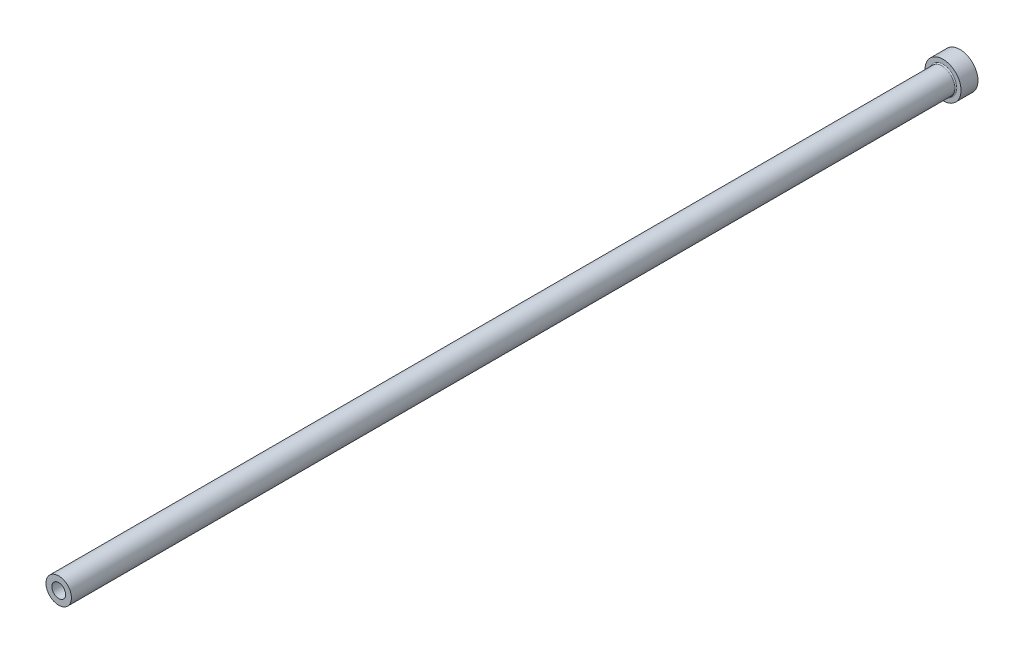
ISO-10303-21;
HEADER;
FILE_DESCRIPTION(('STEP AP214'),'2;1');
FILE_NAME('part.step','',(''),(''),'','','');
FILE_SCHEMA(('AUTOMOTIVE_DESIGN { 1 0 10303 214 1 1 1 1 }'));
ENDSEC;
DATA;
#1=APPLICATION_CONTEXT('core data for automotive mechanical design processes');
#2=APPLICATION_PROTOCOL_DEFINITION('international standard','automotive_design',2000,#1);
#3=PRODUCT_CONTEXT('',#1,'mechanical');
#4=PRODUCT('Part','Part','',(#3));
#5=PRODUCT_RELATED_PRODUCT_CATEGORY('part','',(#4));
#6=PRODUCT_DEFINITION_FORMATION('','',#4);
#7=PRODUCT_DEFINITION_CONTEXT('part definition',#1,'design');
#8=PRODUCT_DEFINITION('design','',#6,#7);
#9=PRODUCT_DEFINITION_SHAPE('','',#8);
#10=(LENGTH_UNIT() NAMED_UNIT(*) SI_UNIT(.MILLI.,.METRE.));
#11=(NAMED_UNIT(*) PLANE_ANGLE_UNIT() SI_UNIT($,.RADIAN.));
#12=(NAMED_UNIT(*) SI_UNIT($,.STERADIAN.) SOLID_ANGLE_UNIT());
#13=UNCERTAINTY_MEASURE_WITH_UNIT(LENGTH_MEASURE(1.E-05),#10,'distance_accuracy_value','');
#14=(GEOMETRIC_REPRESENTATION_CONTEXT(3) GLOBAL_UNCERTAINTY_ASSIGNED_CONTEXT((#13)) GLOBAL_UNIT_ASSIGNED_CONTEXT((#10,
#11,#12)) REPRESENTATION_CONTEXT('',''));
#15=CARTESIAN_POINT('',(0.,0.,0.));
#16=DIRECTION('',(0.,0.,1.));
#17=DIRECTION('',(1.,0.,0.));
#18=AXIS2_PLACEMENT_3D('',#15,#16,#17);
#19=CARTESIAN_POINT('',(0.,0.,425.));
#20=DIRECTION('',(0.,0.,-1.));
#21=DIRECTION('',(-1.,0.,0.));
#22=AXIS2_PLACEMENT_3D('',#19,#20,#21);
#23=PLANE('',#22);
#24=CARTESIAN_POINT('',(0.,0.,425.));
#25=DIRECTION('',(0.,0.,1.));
#26=DIRECTION('',(1.,0.,0.));
#27=AXIS2_PLACEMENT_3D('',#24,#25,#26);
#28=CIRCLE('',#27,3.24999999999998);
#29=CARTESIAN_POINT('',(3.24999999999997,0.,425.));
#30=VERTEX_POINT('',#29);
#31=EDGE_CURVE('E63',#30,#30,#28,.T.);
#32=ORIENTED_EDGE('',*,*,#31,.F.);
#33=EDGE_LOOP('',(#32));
#34=FACE_BOUND('',#33,.T.);
#35=CARTESIAN_POINT('',(0.,0.,425.));
#36=DIRECTION('',(0.,0.,1.));
#37=DIRECTION('',(1.,0.,0.));
#38=AXIS2_PLACEMENT_3D('',#35,#36,#37);
#39=CIRCLE('',#38,5.99999999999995);
#40=CARTESIAN_POINT('',(5.99999999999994,0.,425.));
#41=VERTEX_POINT('',#40);
#42=EDGE_CURVE('E54',#41,#41,#39,.T.);
#43=ORIENTED_EDGE('',*,*,#42,.T.);
#44=EDGE_LOOP('',(#43));
#45=FACE_BOUND('',#44,.T.);
#46=ADVANCED_FACE('F34',(#34,#45),#23,.F.);
#47=CARTESIAN_POINT('',(0.,0.,425.));
#48=DIRECTION('',(0.,0.,1.));
#49=DIRECTION('',(1.,0.,0.));
#50=AXIS2_PLACEMENT_3D('',#47,#48,#49);
#51=CYLINDRICAL_SURFACE('',#50,5.99999999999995);
#52=CARTESIAN_POINT('',(0.,0.,8.50000000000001));
#53=DIRECTION('',(0.,0.,1.));
#54=DIRECTION('',(1.,0.,0.));
#55=AXIS2_PLACEMENT_3D('',#52,#53,#54);
#56=CIRCLE('',#55,5.99999999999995);
#57=CARTESIAN_POINT('',(5.99999999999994,0.,8.50000000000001));
#58=VERTEX_POINT('',#57);
#59=EDGE_CURVE('E49',#58,#58,#56,.T.);
#60=ORIENTED_EDGE('',*,*,#59,.T.);
#61=EDGE_LOOP('',(#60));
#62=FACE_BOUND('',#61,.T.);
#63=ORIENTED_EDGE('',*,*,#42,.F.);
#64=EDGE_LOOP('',(#63));
#65=FACE_BOUND('',#64,.T.);
#66=ADVANCED_FACE('F92',(#62,#65),#51,.T.);
#67=CARTESIAN_POINT('',(0.,0.,8.));
#68=DIRECTION('',(0.,0.,1.));
#69=DIRECTION('',(1.,0.,0.));
#70=AXIS2_PLACEMENT_3D('',#67,#68,#69);
#71=PLANE('',#70);
#72=CARTESIAN_POINT('',(0.,0.,8.));
#73=DIRECTION('',(0.,0.,1.));
#74=DIRECTION('',(1.,0.,0.));
#75=AXIS2_PLACEMENT_3D('',#72,#73,#74);
#76=CIRCLE('',#75,6.49999999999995);
#77=CARTESIAN_POINT('',(6.49999999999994,0.,8.));
#78=VERTEX_POINT('',#77);
#79=EDGE_CURVE('E45',#78,#78,#76,.F.);
#80=ORIENTED_EDGE('',*,*,#79,.T.);
#81=EDGE_LOOP('',(#80));
#82=FACE_BOUND('',#81,.T.);
#83=CARTESIAN_POINT('',(0.,0.,8.00000000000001));
#84=DIRECTION('',(0.,0.,1.));
#85=DIRECTION('',(1.,0.,0.));
#86=AXIS2_PLACEMENT_3D('',#83,#84,#85);
#87=CIRCLE('',#86,8.49999999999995);
#88=CARTESIAN_POINT('',(8.49999999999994,0.,8.00000000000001));
#89=VERTEX_POINT('',#88);
#90=EDGE_CURVE('E57',#89,#89,#87,.T.);
#91=ORIENTED_EDGE('',*,*,#90,.T.);
#92=EDGE_LOOP('',(#91));
#93=FACE_BOUND('',#92,.T.);
#94=ADVANCED_FACE('F98',(#82,#93),#71,.T.);
#95=CARTESIAN_POINT('',(0.,0.,425.));
#96=DIRECTION('',(0.,0.,1.));
#97=DIRECTION('',(1.,0.,0.));
#98=AXIS2_PLACEMENT_3D('',#95,#96,#97);
#99=CYLINDRICAL_SURFACE('',#98,8.49999999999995);
#100=ORIENTED_EDGE('',*,*,#90,.F.);
#101=EDGE_LOOP('',(#100));
#102=FACE_BOUND('',#101,.T.);
#103=CARTESIAN_POINT('',(0.,0.,0.));
#104=DIRECTION('',(0.,0.,1.));
#105=DIRECTION('',(1.,0.,0.));
#106=AXIS2_PLACEMENT_3D('',#103,#104,#105);
#107=CIRCLE('',#106,8.49999999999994);
#108=CARTESIAN_POINT('',(8.49999999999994,0.,0.));
#109=VERTEX_POINT('',#108);
#110=EDGE_CURVE('E60',#109,#109,#107,.T.);
#111=ORIENTED_EDGE('',*,*,#110,.T.);
#112=EDGE_LOOP('',(#111));
#113=FACE_BOUND('',#112,.T.);
#114=ADVANCED_FACE('F89',(#102,#113),#99,.T.);
#115=CARTESIAN_POINT('',(0.,0.,0.));
#116=DIRECTION('',(0.,0.,1.));
#117=DIRECTION('',(1.,0.,0.));
#118=AXIS2_PLACEMENT_3D('',#115,#116,#117);
#119=PLANE('',#118);
#120=CARTESIAN_POINT('',(0.,0.,0.));
#121=DIRECTION('',(0.,0.,1.));
#122=DIRECTION('',(1.,0.,0.));
#123=AXIS2_PLACEMENT_3D('',#120,#121,#122);
#124=CIRCLE('',#123,3.99999999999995);
#125=CARTESIAN_POINT('',(3.99999999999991,0.,0.));
#126=VERTEX_POINT('',#125);
#127=EDGE_CURVE('E41',#126,#126,#124,.T.);
#128=ORIENTED_EDGE('',*,*,#127,.T.);
#129=EDGE_LOOP('',(#128));
#130=FACE_BOUND('',#129,.T.);
#131=ORIENTED_EDGE('',*,*,#110,.F.);
#132=EDGE_LOOP('',(#131));
#133=FACE_BOUND('',#132,.T.);
#134=ADVANCED_FACE('F83',(#130,#133),#119,.F.);
#135=CARTESIAN_POINT('',(0.,0.,425.));
#136=DIRECTION('',(0.,0.,1.));
#137=DIRECTION('',(1.,0.,0.));
#138=AXIS2_PLACEMENT_3D('',#135,#136,#137);
#139=CYLINDRICAL_SURFACE('',#138,3.25000000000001);
#140=ORIENTED_EDGE('',*,*,#31,.T.);
#141=EDGE_LOOP('',(#140));
#142=FACE_BOUND('',#141,.T.);
#143=CARTESIAN_POINT('',(0.,0.,275.));
#144=DIRECTION('',(0.,0.,1.));
#145=DIRECTION('',(1.,0.,0.));
#146=AXIS2_PLACEMENT_3D('',#143,#144,#145);
#147=CIRCLE('',#146,3.25000000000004);
#148=CARTESIAN_POINT('',(3.25000000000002,0.,275.));
#149=VERTEX_POINT('',#148);
#150=EDGE_CURVE('E66',#149,#149,#147,.T.);
#151=ORIENTED_EDGE('',*,*,#150,.F.);
#152=EDGE_LOOP('',(#151));
#153=FACE_BOUND('',#152,.T.);
#154=ADVANCED_FACE('F78',(#142,#153),#139,.F.);
#155=CARTESIAN_POINT('',(0.,0.,275.));
#156=DIRECTION('',(0.,0.,-1.));
#157=DIRECTION('',(-1.,0.,0.));
#158=AXIS2_PLACEMENT_3D('',#155,#156,#157);
#159=CONICAL_SURFACE('',#158,3.25000000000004,0.523598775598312);
#160=CARTESIAN_POINT('',(0.,0.,274.566987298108));
#161=DIRECTION('',(0.,0.,1.));
#162=DIRECTION('',(1.,0.,0.));
#163=AXIS2_PLACEMENT_3D('',#160,#161,#162);
#164=CIRCLE('',#163,3.49999999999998);
#165=CARTESIAN_POINT('',(3.49999999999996,0.,274.566987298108));
#166=VERTEX_POINT('',#165);
#167=EDGE_CURVE('E69',#166,#166,#164,.T.);
#168=ORIENTED_EDGE('',*,*,#167,.F.);
#169=EDGE_LOOP('',(#168));
#170=FACE_BOUND('',#169,.T.);
#171=ORIENTED_EDGE('',*,*,#150,.T.);
#172=EDGE_LOOP('',(#171));
#173=FACE_BOUND('',#172,.T.);
#174=ADVANCED_FACE('F75',(#170,#173),#159,.F.);
#175=CARTESIAN_POINT('',(0.,0.,425.));
#176=DIRECTION('',(0.,0.,1.));
#177=DIRECTION('',(1.,0.,0.));
#178=AXIS2_PLACEMENT_3D('',#175,#176,#177);
#179=CYLINDRICAL_SURFACE('',#178,3.49999999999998);
#180=CARTESIAN_POINT('',(0.,0.,0.5));
#181=DIRECTION('',(0.,0.,1.));
#182=DIRECTION('',(1.,0.,0.));
#183=AXIS2_PLACEMENT_3D('',#180,#181,#182);
#184=CIRCLE('',#183,3.49999999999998);
#185=CARTESIAN_POINT('',(3.49999999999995,0.,0.5));
#186=VERTEX_POINT('',#185);
#187=EDGE_CURVE('E10',#186,#186,#184,.F.);
#188=ORIENTED_EDGE('',*,*,#187,.T.);
#189=EDGE_LOOP('',(#188));
#190=FACE_BOUND('',#189,.T.);
#191=ORIENTED_EDGE('',*,*,#167,.T.);
#192=EDGE_LOOP('',(#191));
#193=FACE_BOUND('',#192,.T.);
#194=ADVANCED_FACE('F73',(#190,#193),#179,.F.);
#195=CARTESIAN_POINT('',(0.,0.,8.50000000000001));
#196=DIRECTION('',(0.,0.,1.));
#197=DIRECTION('',(1.,0.,0.));
#198=AXIS2_PLACEMENT_3D('',#195,#196,#197);
#199=TOROIDAL_SURFACE('',#198,6.49999999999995,0.5);
#200=ORIENTED_EDGE('',*,*,#79,.F.);
#201=EDGE_LOOP('',(#200));
#202=FACE_BOUND('',#201,.T.);
#203=ORIENTED_EDGE('',*,*,#59,.F.);
#204=EDGE_LOOP('',(#203));
#205=FACE_BOUND('',#204,.T.);
#206=ADVANCED_FACE('F104',(#202,#205),#199,.F.);
#207=CARTESIAN_POINT('',(0.,0.,0.));
#208=DIRECTION('',(0.,0.,-1.));
#209=DIRECTION('',(-1.,0.,0.));
#210=AXIS2_PLACEMENT_3D('',#207,#208,#209);
#211=CONICAL_SURFACE('',#210,3.99999999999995,0.785398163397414);
#212=ORIENTED_EDGE('',*,*,#187,.F.);
#213=EDGE_LOOP('',(#212));
#214=FACE_BOUND('',#213,.T.);
#215=ORIENTED_EDGE('',*,*,#127,.F.);
#216=EDGE_LOOP('',(#215));
#217=FACE_BOUND('',#216,.T.);
#218=ADVANCED_FACE('F36',(#214,#217),#211,.F.);
#219=CLOSED_SHELL('',(#46,#66,#94,#114,#134,#154,#174,#194,#206,#218));
#220=MANIFOLD_SOLID_BREP('B2',#219);
#221=ADVANCED_BREP_SHAPE_REPRESENTATION('',(#18,#220),#14);
#222=SHAPE_DEFINITION_REPRESENTATION(#9,#221);
ENDSEC;
END-ISO-10303-21;
